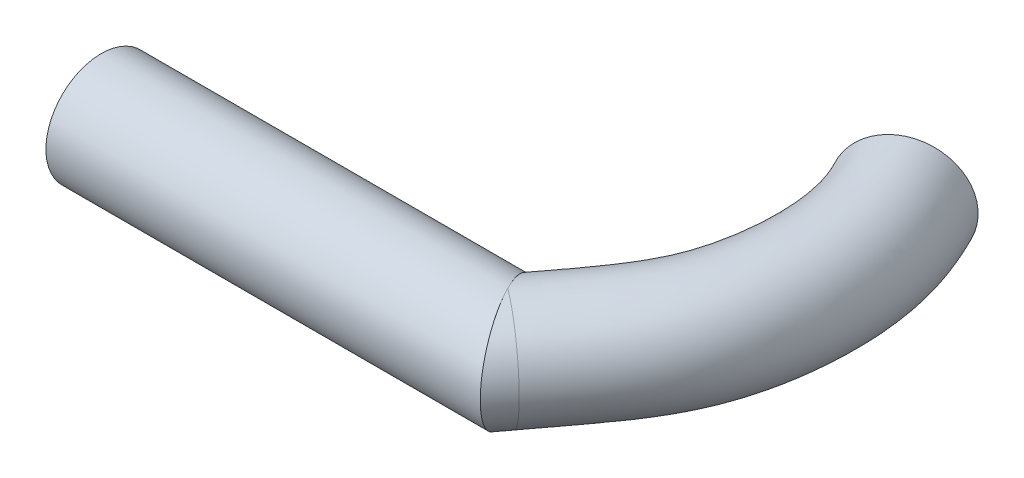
ISO-10303-21;
HEADER;
FILE_DESCRIPTION(('STEP AP214'),'2;1');
FILE_NAME('part.step','',(''),(''),'','','');
FILE_SCHEMA(('AUTOMOTIVE_DESIGN { 1 0 10303 214 1 1 1 1 }'));
ENDSEC;
DATA;
#1=APPLICATION_CONTEXT('core data for automotive mechanical design processes');
#2=APPLICATION_PROTOCOL_DEFINITION('international standard','automotive_design',2000,#1);
#3=PRODUCT_CONTEXT('',#1,'mechanical');
#4=PRODUCT('Part','Part','',(#3));
#5=PRODUCT_RELATED_PRODUCT_CATEGORY('part','',(#4));
#6=PRODUCT_DEFINITION_FORMATION('','',#4);
#7=PRODUCT_DEFINITION_CONTEXT('part definition',#1,'design');
#8=PRODUCT_DEFINITION('design','',#6,#7);
#9=PRODUCT_DEFINITION_SHAPE('','',#8);
#10=(LENGTH_UNIT() NAMED_UNIT(*) SI_UNIT(.MILLI.,.METRE.));
#11=(NAMED_UNIT(*) PLANE_ANGLE_UNIT() SI_UNIT($,.RADIAN.));
#12=(NAMED_UNIT(*) SI_UNIT($,.STERADIAN.) SOLID_ANGLE_UNIT());
#13=UNCERTAINTY_MEASURE_WITH_UNIT(LENGTH_MEASURE(1.E-05),#10,'distance_accuracy_value','');
#14=(GEOMETRIC_REPRESENTATION_CONTEXT(3) GLOBAL_UNCERTAINTY_ASSIGNED_CONTEXT((#13)) GLOBAL_UNIT_ASSIGNED_CONTEXT((#10,
#11,#12)) REPRESENTATION_CONTEXT('',''));
#15=CARTESIAN_POINT('',(0.,0.,0.));
#16=DIRECTION('',(0.,0.,1.));
#17=DIRECTION('',(1.,0.,0.));
#18=AXIS2_PLACEMENT_3D('',#15,#16,#17);
#19=CARTESIAN_POINT('',(78.3138482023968,53.7383808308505,0.));
#20=DIRECTION('',(-0.595766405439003,0.,0.803157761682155));
#21=DIRECTION('',(0.803157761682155,0.,0.595766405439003));
#22=AXIS2_PLACEMENT_3D('',#19,#20,#21);
#23=CYLINDRICAL_SURFACE('',#22,10.65);
#24=CARTESIAN_POINT('',(78.3138482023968,53.7383808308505,0.));
#25=DIRECTION('',(0.595766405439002,0.,-0.803157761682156));
#26=DIRECTION('',(-0.803157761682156,0.,-0.595766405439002));
#27=AXIS2_PLACEMENT_3D('',#24,#25,#26);
#28=CIRCLE('',#27,10.65);
#29=CARTESIAN_POINT('',(78.3138482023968,64.3883808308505,0.));
#30=VERTEX_POINT('',#29);
#31=CARTESIAN_POINT('',(78.3138482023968,43.0883808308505,0.));
#32=VERTEX_POINT('',#31);
#33=EDGE_CURVE('E108',#30,#32,#28,.T.);
#34=ORIENTED_EDGE('',*,*,#33,.F.);
#35=CARTESIAN_POINT('',(78.3138482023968,53.7383808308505,0.));
#36=DIRECTION('',(0.893243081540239,0.,-0.449574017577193));
#37=DIRECTION('',(0.449574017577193,0.,0.893243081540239));
#38=AXIS2_PLACEMENT_3D('',#35,#36,#37);
#39=ELLIPSE('',#38,11.9228463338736,10.65);
#40=EDGE_CURVE('E109',#30,#32,#39,.T.);
#41=ORIENTED_EDGE('',*,*,#40,.T.);
#42=EDGE_LOOP('',(#34,#41));
#43=FACE_BOUND('',#42,.T.);
#44=ADVANCED_FACE('F69',(#43),#23,.T.);
#45=CARTESIAN_POINT('',(78.3138482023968,53.7383808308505,0.));
#46=DIRECTION('',(-0.595766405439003,0.,0.803157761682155));
#47=DIRECTION('',(0.803157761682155,0.,0.595766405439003));
#48=AXIS2_PLACEMENT_3D('',#45,#46,#47);
#49=CYLINDRICAL_SURFACE('',#48,8.34999999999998);
#50=CARTESIAN_POINT('',(78.3138482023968,53.7383808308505,0.));
#51=DIRECTION('',(0.893243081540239,0.,-0.449574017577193));
#52=DIRECTION('',(0.449574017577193,0.,0.893243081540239));
#53=AXIS2_PLACEMENT_3D('',#50,#51,#52);
#54=ELLIPSE('',#53,9.34795933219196,8.34999999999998);
#55=CARTESIAN_POINT('',(78.3138482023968,62.0883808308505,0.));
#56=VERTEX_POINT('',#55);
#57=CARTESIAN_POINT('',(78.3138482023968,45.3883808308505,0.));
#58=VERTEX_POINT('',#57);
#59=EDGE_CURVE('E94',#56,#58,#54,.T.);
#60=ORIENTED_EDGE('',*,*,#59,.F.);
#61=CARTESIAN_POINT('',(78.3138482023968,53.7383808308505,0.));
#62=DIRECTION('',(0.595766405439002,0.,-0.803157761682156));
#63=DIRECTION('',(-0.803157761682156,0.,-0.595766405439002));
#64=AXIS2_PLACEMENT_3D('',#61,#62,#63);
#65=CIRCLE('',#64,8.34999999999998);
#66=EDGE_CURVE('E105',#56,#58,#65,.T.);
#67=ORIENTED_EDGE('',*,*,#66,.T.);
#68=EDGE_LOOP('',(#60,#67));
#69=FACE_BOUND('',#68,.T.);
#70=ADVANCED_FACE('F104',(#69),#49,.F.);
#71=CARTESIAN_POINT('',(91.029410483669,53.7383808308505,-63.5617452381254));
#72=DIRECTION('',(-0.455932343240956,0.,-0.890014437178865));
#73=DIRECTION('',(-0.890014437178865,0.,0.455932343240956));
#74=AXIS2_PLACEMENT_3D('',#71,#72,#73);
#75=PLANE('',#74);
#76=CARTESIAN_POINT('',(91.029410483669,53.7383808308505,-63.5617452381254));
#77=DIRECTION('',(-0.455932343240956,0.,-0.890014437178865));
#78=DIRECTION('',(-0.890014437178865,0.,0.455932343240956));
#79=AXIS2_PLACEMENT_3D('',#76,#77,#78);
#80=CIRCLE('',#79,8.34999999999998);
#81=CARTESIAN_POINT('',(83.5977899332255,53.7383808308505,-59.7547101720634));
#82=VERTEX_POINT('',#81);
#83=EDGE_CURVE('E111',#82,#82,#80,.T.);
#84=ORIENTED_EDGE('',*,*,#83,.F.);
#85=EDGE_LOOP('',(#84));
#86=FACE_BOUND('',#85,.T.);
#87=CARTESIAN_POINT('',(91.029410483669,53.7383808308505,-63.5617452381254));
#88=DIRECTION('',(-0.455932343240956,0.,-0.890014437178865));
#89=DIRECTION('',(-0.890014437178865,0.,0.455932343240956));
#90=AXIS2_PLACEMENT_3D('',#87,#88,#89);
#91=CIRCLE('',#90,10.65);
#92=CARTESIAN_POINT('',(81.5507567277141,53.7383808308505,-58.7060657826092));
#93=VERTEX_POINT('',#92);
#94=EDGE_CURVE('E81',#93,#93,#91,.T.);
#95=ORIENTED_EDGE('',*,*,#94,.T.);
#96=EDGE_LOOP('',(#95));
#97=FACE_BOUND('',#96,.T.);
#98=ADVANCED_FACE('F121',(#86,#97),#75,.T.);
#99=CARTESIAN_POINT('',(81.5507567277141,53.7383808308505,-58.7060657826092));
#100=CARTESIAN_POINT('',(82.8786348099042,53.7383808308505,-56.2032188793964));
#101=CARTESIAN_POINT('',(84.548425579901,53.7383808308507,-51.7664991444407));
#102=CARTESIAN_POINT('',(85.3403182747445,53.7383808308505,-47.1848290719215));
#103=CARTESIAN_POINT('',(85.7042953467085,53.7383808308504,-42.1390190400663));
#104=CARTESIAN_POINT('',(85.5759898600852,53.7383808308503,-36.2475260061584));
#105=CARTESIAN_POINT('',(84.4349783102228,53.7383808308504,-30.6019649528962));
#106=CARTESIAN_POINT('',(82.9979298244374,53.7383808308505,-26.0586618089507));
#107=CARTESIAN_POINT('',(81.1404006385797,53.7383808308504,-22.0645461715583));
#108=CARTESIAN_POINT('',(76.8912262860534,53.7383808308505,-15.7107844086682));
#109=CARTESIAN_POINT('',(72.2878550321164,53.7383808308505,-9.75060302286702));
#110=CARTESIAN_POINT('',(69.7602180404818,53.7383808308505,-6.34491221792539));
#111=CARTESIAN_POINT('',(81.5507567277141,32.4383808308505,-58.7060657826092));
#112=CARTESIAN_POINT('',(82.8786348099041,32.4383808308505,-56.2032188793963));
#113=CARTESIAN_POINT('',(84.5484255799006,32.4383808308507,-51.7664991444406));
#114=CARTESIAN_POINT('',(85.3403182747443,32.4383808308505,-47.1848290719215));
#115=CARTESIAN_POINT('',(85.7042953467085,32.4383808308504,-42.1390190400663));
#116=CARTESIAN_POINT('',(85.5759898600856,32.4383808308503,-36.2475260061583));
#117=CARTESIAN_POINT('',(84.4349783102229,32.4383808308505,-30.6019649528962));
#118=CARTESIAN_POINT('',(82.9979298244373,32.4383808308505,-26.0586618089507));
#119=CARTESIAN_POINT('',(81.1404006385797,32.4383808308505,-22.0645461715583));
#120=CARTESIAN_POINT('',(76.8912262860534,32.4383808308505,-15.7107844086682));
#121=CARTESIAN_POINT('',(72.2878550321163,32.4383808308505,-9.75060302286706));
#122=CARTESIAN_POINT('',(69.7602180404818,32.4383808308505,-6.34491221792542));
#123=CARTESIAN_POINT('',(100.508064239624,32.4383808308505,-68.4174246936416));
#124=CARTESIAN_POINT('',(102.42940117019,32.4383808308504,-64.5775580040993));
#125=CARTESIAN_POINT('',(105.214732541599,32.4383808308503,-57.627606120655));
#126=CARTESIAN_POINT('',(106.486193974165,32.4383808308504,-50.0105061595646));
#127=CARTESIAN_POINT('',(107.055525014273,32.4383808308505,-42.2724069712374));
#128=CARTESIAN_POINT('',(106.835829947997,32.4383808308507,-34.0211809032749));
#129=CARTESIAN_POINT('',(105.233768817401,32.4383808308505,-25.6366099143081));
#130=CARTESIAN_POINT('',(102.812711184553,32.4383808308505,-18.1837587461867));
#131=CARTESIAN_POINT('',(99.5645066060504,32.4383808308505,-11.1155226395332));
#132=CARTESIAN_POINT('',(93.7977548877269,32.4383808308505,-2.76138064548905));
#133=CARTESIAN_POINT('',(89.3282047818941,32.4383808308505,3.02574785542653));
#134=CARTESIAN_POINT('',(86.8674783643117,32.4383808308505,6.34491221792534));
#135=CARTESIAN_POINT('',(100.508064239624,53.7383808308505,-68.4174246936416));
#136=CARTESIAN_POINT('',(102.42940117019,53.7383808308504,-64.5775580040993));
#137=CARTESIAN_POINT('',(105.2147325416,53.7383808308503,-57.6276061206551));
#138=CARTESIAN_POINT('',(106.486193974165,53.7383808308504,-50.0105061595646));
#139=CARTESIAN_POINT('',(107.055525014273,53.7383808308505,-42.2724069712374));
#140=CARTESIAN_POINT('',(106.835829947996,53.7383808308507,-34.021180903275));
#141=CARTESIAN_POINT('',(105.233768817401,53.7383808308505,-25.6366099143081));
#142=CARTESIAN_POINT('',(102.812711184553,53.7383808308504,-18.1837587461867));
#143=CARTESIAN_POINT('',(99.5645066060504,53.7383808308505,-11.1155226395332));
#144=CARTESIAN_POINT('',(93.7977548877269,53.7383808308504,-2.761380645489));
#145=CARTESIAN_POINT('',(89.3282047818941,53.7383808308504,3.02574785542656));
#146=CARTESIAN_POINT('',(86.8674783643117,53.7383808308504,6.34491221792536));
#147=CARTESIAN_POINT('',(100.508064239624,75.0383808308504,-68.4174246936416));
#148=CARTESIAN_POINT('',(102.42940117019,75.0383808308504,-64.5775580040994));
#149=CARTESIAN_POINT('',(105.2147325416,75.0383808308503,-57.6276061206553));
#150=CARTESIAN_POINT('',(106.486193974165,75.0383808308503,-50.0105061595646));
#151=CARTESIAN_POINT('',(107.055525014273,75.0383808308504,-42.2724069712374));
#152=CARTESIAN_POINT('',(106.835829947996,75.0383808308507,-34.0211809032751));
#153=CARTESIAN_POINT('',(105.233768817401,75.0383808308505,-25.6366099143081));
#154=CARTESIAN_POINT('',(102.812711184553,75.0383808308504,-18.1837587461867));
#155=CARTESIAN_POINT('',(99.5645066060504,75.0383808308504,-11.1155226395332));
#156=CARTESIAN_POINT('',(93.797754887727,75.0383808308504,-2.76138064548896));
#157=CARTESIAN_POINT('',(89.3282047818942,75.0383808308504,3.0257478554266));
#158=CARTESIAN_POINT('',(86.8674783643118,75.0383808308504,6.3449122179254));
#159=CARTESIAN_POINT('',(81.5507567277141,75.0383808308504,-58.7060657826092));
#160=CARTESIAN_POINT('',(82.8786348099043,75.0383808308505,-56.2032188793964));
#161=CARTESIAN_POINT('',(84.5484255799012,75.0383808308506,-51.7664991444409));
#162=CARTESIAN_POINT('',(85.3403182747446,75.0383808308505,-47.1848290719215));
#163=CARTESIAN_POINT('',(85.7042953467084,75.0383808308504,-42.1390190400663));
#164=CARTESIAN_POINT('',(85.5759898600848,75.0383808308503,-36.2475260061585));
#165=CARTESIAN_POINT('',(84.4349783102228,75.0383808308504,-30.6019649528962));
#166=CARTESIAN_POINT('',(82.9979298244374,75.0383808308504,-26.0586618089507));
#167=CARTESIAN_POINT('',(81.1404006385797,75.0383808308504,-22.0645461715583));
#168=CARTESIAN_POINT('',(76.8912262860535,75.0383808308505,-15.7107844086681));
#169=CARTESIAN_POINT('',(72.2878550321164,75.0383808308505,-9.75060302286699));
#170=CARTESIAN_POINT('',(69.7602180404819,75.0383808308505,-6.34491221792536));
#171=CARTESIAN_POINT('',(81.5507567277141,53.7383808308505,-58.7060657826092));
#172=CARTESIAN_POINT('',(82.8786348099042,53.7383808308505,-56.2032188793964));
#173=CARTESIAN_POINT('',(84.548425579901,53.7383808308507,-51.7664991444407));
#174=CARTESIAN_POINT('',(85.3403182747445,53.7383808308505,-47.1848290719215));
#175=CARTESIAN_POINT('',(85.7042953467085,53.7383808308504,-42.1390190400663));
#176=CARTESIAN_POINT('',(85.5759898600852,53.7383808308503,-36.2475260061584));
#177=CARTESIAN_POINT('',(84.4349783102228,53.7383808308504,-30.6019649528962));
#178=CARTESIAN_POINT('',(82.9979298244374,53.7383808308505,-26.0586618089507));
#179=CARTESIAN_POINT('',(81.1404006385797,53.7383808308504,-22.0645461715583));
#180=CARTESIAN_POINT('',(76.8912262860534,53.7383808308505,-15.7107844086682));
#181=CARTESIAN_POINT('',(72.2878550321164,53.7383808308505,-9.75060302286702));
#182=CARTESIAN_POINT('',(69.7602180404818,53.7383808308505,-6.34491221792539));
#183=(BOUNDED_SURFACE() B_SPLINE_SURFACE(3,3,((#99,#100,#101,#102,#103,#104,#105,#106,#107,#108,
#109,#110),(#111,#112,#113,#114,#115,#116,#117,#118,#119,#120,#121,#122),(#123,#124,#125,#126,
#127,#128,#129,#130,#131,#132,#133,#134),(#135,#136,#137,#138,#139,#140,#141,#142,#143,#144,
#145,#146),(#147,#148,#149,#150,#151,#152,#153,#154,#155,#156,#157,#158),(#159,#160,#161,#162,
#163,#164,#165,#166,#167,#168,#169,#170),(#171,#172,#173,#174,#175,#176,#177,#178,#179,#180,
#181,#182)),.UNSPECIFIED.,.T.,.F.,.F.) B_SPLINE_SURFACE_WITH_KNOTS((4,3,4),(4,1,1,1,1,1,1,1,1,
4),(0.,0.5,1.),(0.,0.14,0.263161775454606,0.280000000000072,0.42,0.559999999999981,
0.585352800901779,0.706666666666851,0.853333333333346,1.),
.UNSPECIFIED.) GEOMETRIC_REPRESENTATION_ITEM() RATIONAL_B_SPLINE_SURFACE(((1.,1.,1.,1.,1.,1.,1.,
1.,1.,1.,1.,1.),(0.333333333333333,0.333333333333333,0.333333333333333,0.333333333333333,
0.333333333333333,0.333333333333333,0.333333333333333,0.333333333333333,0.333333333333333,
0.333333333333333,0.333333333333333,0.333333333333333),(0.333333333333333,0.333333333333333,
0.333333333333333,0.333333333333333,0.333333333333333,0.333333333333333,0.333333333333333,
0.333333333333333,0.333333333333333,0.333333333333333,0.333333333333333,0.333333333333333),(1.,
1.,1.,1.,1.,1.,1.,1.,1.,1.,1.,1.),(0.333333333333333,0.333333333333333,0.333333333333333,
0.333333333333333,0.333333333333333,0.333333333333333,0.333333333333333,0.333333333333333,
0.333333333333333,0.333333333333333,0.333333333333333,0.333333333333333),(0.333333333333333,
0.333333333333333,0.333333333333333,0.333333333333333,0.333333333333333,0.333333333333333,
0.333333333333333,0.333333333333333,0.333333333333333,0.333333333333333,0.333333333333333,
0.333333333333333),(1.,1.,1.,1.,1.,1.,1.,1.,1.,1.,1.,1.))) REPRESENTATION_ITEM('') SURFACE());
#184=CARTESIAN_POINT('',(78.3138482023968,64.3883808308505,0.));
#185=CARTESIAN_POINT('',(78.1495773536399,64.3883922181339,-0.326384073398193));
#186=CARTESIAN_POINT('',(77.985299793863,64.3733771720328,-0.652781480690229));
#187=CARTESIAN_POINT('',(77.657824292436,64.3133020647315,-1.30343123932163));
#188=CARTESIAN_POINT('',(77.4946265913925,64.2682355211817,-1.62768311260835));
#189=CARTESIAN_POINT('',(77.1699527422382,64.1478713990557,-2.27276636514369));
#190=CARTESIAN_POINT('',(77.0084838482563,64.0724767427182,-2.59358333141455));
#191=CARTESIAN_POINT('',(76.6889971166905,63.8915775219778,-3.22836047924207));
#192=CARTESIAN_POINT('',(76.5309790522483,63.7860749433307,-3.5423211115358));
#193=CARTESIAN_POINT('',(76.2193067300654,63.5449458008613,-4.16157207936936));
#194=CARTESIAN_POINT('',(76.0656615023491,63.4092613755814,-4.46684447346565));
#195=CARTESIAN_POINT('',(75.7643506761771,63.1082647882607,-5.0655085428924));
#196=CARTESIAN_POINT('',(75.6166847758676,62.9429541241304,-5.35890081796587));
#197=CARTESIAN_POINT('',(75.3288377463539,62.5834719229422,-5.93081413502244));
#198=CARTESIAN_POINT('',(75.1886484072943,62.3893329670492,-6.20935148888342));
#199=CARTESIAN_POINT('',(74.9169934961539,61.9728856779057,-6.74909324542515));
#200=CARTESIAN_POINT('',(74.7855271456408,61.7505798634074,-7.0102991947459));
#201=CARTESIAN_POINT('',(74.5410887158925,61.2944540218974,-7.49596546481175));
#202=CARTESIAN_POINT('',(74.4274690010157,61.0623512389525,-7.72171255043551));
#203=CARTESIAN_POINT('',(74.2103483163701,60.5758163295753,-8.15310213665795));
#204=CARTESIAN_POINT('',(74.1068459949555,60.321387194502,-8.35874732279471));
#205=CARTESIAN_POINT('',(73.9112102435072,59.7918588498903,-8.74744923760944));
#206=CARTESIAN_POINT('',(73.8190731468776,59.5167663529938,-8.93051325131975));
#207=CARTESIAN_POINT('',(73.6473425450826,58.9478440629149,-9.27171885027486));
#208=CARTESIAN_POINT('',(73.5677474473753,58.654016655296,-9.42986359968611));
#209=CARTESIAN_POINT('',(73.4302052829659,58.0831423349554,-9.70314137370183));
#210=CARTESIAN_POINT('',(73.3708422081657,57.8077800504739,-9.82108781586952));
#211=CARTESIAN_POINT('',(73.2636898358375,57.246147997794,-10.0339851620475));
#212=CARTESIAN_POINT('',(73.2158988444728,56.9598798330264,-10.1289394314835));
#213=CARTESIAN_POINT('',(73.132531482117,56.3788505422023,-10.294579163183));
#214=CARTESIAN_POINT('',(73.096947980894,56.0840944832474,-10.3652787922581));
#215=CARTESIAN_POINT('',(73.0384458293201,55.4884281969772,-10.4815146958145));
#216=CARTESIAN_POINT('',(73.0155263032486,55.187518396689,-10.5270527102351));
#217=CARTESIAN_POINT('',(72.9841648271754,54.6097084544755,-10.5893637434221));
#218=CARTESIAN_POINT('',(72.974597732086,54.3331077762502,-10.6083722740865));
#219=CARTESIAN_POINT('',(72.9663105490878,53.7791146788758,-10.6248377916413));
#220=CARTESIAN_POINT('',(72.9675896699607,53.5017223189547,-10.6222963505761));
#221=CARTESIAN_POINT('',(72.9809774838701,52.9482889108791,-10.5956965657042));
#222=CARTESIAN_POINT('',(72.9930842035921,52.6722476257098,-10.5716421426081));
#223=CARTESIAN_POINT('',(73.0279801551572,52.1235279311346,-10.5023085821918));
#224=CARTESIAN_POINT('',(73.0507694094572,51.8508495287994,-10.4570294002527));
#225=CARTESIAN_POINT('',(73.1059673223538,51.3185241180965,-10.3473585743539));
#226=CARTESIAN_POINT('',(73.1380842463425,51.0587269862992,-10.2835465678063));
#227=CARTESIAN_POINT('',(73.2118065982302,50.5458967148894,-10.1370701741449));
#228=CARTESIAN_POINT('',(73.2534117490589,50.292863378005,-10.0544063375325));
#229=CARTESIAN_POINT('',(73.3456900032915,49.7951058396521,-9.87106186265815));
#230=CARTESIAN_POINT('',(73.3963637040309,49.5503821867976,-9.77038003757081));
#231=CARTESIAN_POINT('',(73.5062885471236,49.0706639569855,-9.55197416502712));
#232=CARTESIAN_POINT('',(73.565539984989,48.8356697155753,-9.43424953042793));
#233=CARTESIAN_POINT('',(73.6946133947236,48.3674761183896,-9.1777980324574));
#234=CARTESIAN_POINT('',(73.764763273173,48.1347241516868,-9.03841966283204));
#235=CARTESIAN_POINT('',(73.9131152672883,47.68229827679,-8.74366421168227));
#236=CARTESIAN_POINT('',(73.9913175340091,47.4626246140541,-8.58828683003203));
#237=CARTESIAN_POINT('',(74.1551093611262,47.0373744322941,-8.26285450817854));
#238=CARTESIAN_POINT('',(74.2406988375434,46.8317977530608,-8.09279973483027));
#239=CARTESIAN_POINT('',(74.4186261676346,46.435509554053,-7.73928207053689));
#240=CARTESIAN_POINT('',(74.5109665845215,46.2448037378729,-7.55581408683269));
#241=CARTESIAN_POINT('',(74.7099426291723,45.86322375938,-7.16047545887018));
#242=CARTESIAN_POINT('',(74.8171241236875,45.6737571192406,-6.94752025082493));
#243=CARTESIAN_POINT('',(75.0378364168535,45.3139031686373,-6.50899462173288));
#244=CARTESIAN_POINT('',(75.1513699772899,45.1435242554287,-6.28341871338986));
#245=CARTESIAN_POINT('',(75.3839748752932,44.8224077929,-5.82126407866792));
#246=CARTESIAN_POINT('',(75.5030483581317,44.671677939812,-5.58468108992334));
#247=CARTESIAN_POINT('',(75.7459079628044,44.39033181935,-5.10215173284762));
#248=CARTESIAN_POINT('',(75.869694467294,44.259717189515,-4.85620460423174));
#249=CARTESIAN_POINT('',(76.1341685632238,44.0065035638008,-4.33073016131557));
#250=CARTESIAN_POINT('',(76.2752842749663,43.8861135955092,-4.05035222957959));
#251=CARTESIAN_POINT('',(76.56129830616,43.6704731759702,-3.4820808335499));
#252=CARTESIAN_POINT('',(76.7061956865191,43.5752165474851,-3.19418923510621));
#253=CARTESIAN_POINT('',(76.9987648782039,43.4100233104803,-2.61289361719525));
#254=CARTESIAN_POINT('',(77.1464346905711,43.340069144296,-2.31949356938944));
#255=CARTESIAN_POINT('',(77.4436932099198,43.2254994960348,-1.72888088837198));
#256=CARTESIAN_POINT('',(77.5932811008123,43.1808735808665,-1.43166987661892));
#257=CARTESIAN_POINT('',(77.8382663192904,43.1287120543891,-0.944917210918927));
#258=CARTESIAN_POINT('',(77.9333499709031,43.1135707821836,-0.755998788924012));
#259=CARTESIAN_POINT('',(78.1235693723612,43.0934142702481,-0.378058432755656));
#260=CARTESIAN_POINT('',(78.2187047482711,43.0883815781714,-0.189037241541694));
#261=CARTESIAN_POINT('',(78.3138482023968,43.0883808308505,0.));
#262=B_SPLINE_CURVE_WITH_KNOTS('',3,(#184,#185,#186,#187,#188,#189,#190,#191,#192,#193,#194,
#195,#196,#197,#198,#199,#200,#201,#202,#203,#204,#205,#206,#207,#208,#209,#210,#211,#212,#213,
#214,#215,#216,#217,#218,#219,#220,#221,#222,#223,#224,#225,#226,#227,#228,#229,#230,#231,#232,
#233,#234,#235,#236,#237,#238,#239,#240,#241,#242,#243,#244,#245,#246,#247,#248,#249,#250,#251,
#252,#253,#254,#255,#256,#257,#258,#259,#260,#261),.UNSPECIFIED.,.F.,.F.,(4,2,2,2,2,2,2,2,2,2,2,
2,2,2,2,2,2,2,2,2,2,2,2,2,2,2,2,2,2,2,2,2,2,2,2,2,2,2,4),(0.,1.09589237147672,2.19202121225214,
3.29168695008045,4.39128017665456,5.49299987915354,6.59466389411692,7.69509217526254,
8.7954221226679,9.82342852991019,10.8512974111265,11.878833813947,12.9062396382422,
13.8211655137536,14.7359573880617,15.6502140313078,16.5644074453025,17.3956324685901,
18.2267968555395,19.0578097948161,19.8888244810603,20.6962259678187,21.5036038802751,
22.3110349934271,23.1184939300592,23.9582356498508,24.797993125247,25.6377410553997,
26.4778094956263,27.3904202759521,28.3034309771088,29.2167982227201,30.1302397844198,
31.1377063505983,32.1449250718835,33.1514435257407,34.157547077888,34.7934402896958,
35.4282346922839),.UNSPECIFIED.);
#263=EDGE_CURVE('E87',#30,#32,#262,.T.);
#264=ORIENTED_EDGE('',*,*,#263,.F.);
#265=ORIENTED_EDGE('',*,*,#33,.T.);
#266=EDGE_LOOP('',(#264,#265));
#267=FACE_BOUND('',#266,.T.);
#268=ORIENTED_EDGE('',*,*,#94,.F.);
#269=EDGE_LOOP('',(#268));
#270=FACE_BOUND('',#269,.T.);
#271=ADVANCED_FACE('F123',(#267,#270),#183,.T.);
#272=CARTESIAN_POINT('',(83.5977899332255,53.7383808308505,-59.7547101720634));
#273=CARTESIAN_POINT('',(84.9897504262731,53.7383808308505,-57.1074902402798));
#274=CARTESIAN_POINT('',(86.7799986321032,53.7383808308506,-52.3993886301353));
#275=CARTESIAN_POINT('',(87.623675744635,53.7383808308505,-47.4899491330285));
#276=CARTESIAN_POINT('',(88.009827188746,53.7383808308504,-42.1534224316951));
#277=CARTESIAN_POINT('',(87.8716533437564,53.7383808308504,-36.0071225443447));
#278=CARTESIAN_POINT('',(86.6808570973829,53.7383808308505,-30.0657998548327));
#279=CARTESIAN_POINT('',(85.1375541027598,53.7383808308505,-25.2083201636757));
#280=CARTESIAN_POINT('',(83.1298580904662,53.7383808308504,-20.882257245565));
#281=CARTESIAN_POINT('',(78.7168138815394,53.7383808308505,-14.3124919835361));
#282=CARTESIAN_POINT('',(74.1278927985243,53.7383808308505,-8.37099705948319));
#283=CARTESIAN_POINT('',(71.6074808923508,53.7383808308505,-4.97464948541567));
#284=CARTESIAN_POINT('',(83.5977899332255,37.0383808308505,-59.7547101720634));
#285=CARTESIAN_POINT('',(84.989750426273,37.0383808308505,-57.1074902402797));
#286=CARTESIAN_POINT('',(86.7799986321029,37.0383808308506,-52.3993886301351));
#287=CARTESIAN_POINT('',(87.6236757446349,37.0383808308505,-47.4899491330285));
#288=CARTESIAN_POINT('',(88.009827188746,37.0383808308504,-42.1534224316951));
#289=CARTESIAN_POINT('',(87.8716533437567,37.0383808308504,-36.0071225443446));
#290=CARTESIAN_POINT('',(86.6808570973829,37.0383808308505,-30.0657998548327));
#291=CARTESIAN_POINT('',(85.1375541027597,37.0383808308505,-25.2083201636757));
#292=CARTESIAN_POINT('',(83.1298580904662,37.0383808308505,-20.8822572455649));
#293=CARTESIAN_POINT('',(78.7168138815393,37.0383808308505,-14.3124919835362));
#294=CARTESIAN_POINT('',(74.1278927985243,37.0383808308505,-8.37099705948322));
#295=CARTESIAN_POINT('',(71.6074808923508,37.0383808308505,-4.97464948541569));
#296=CARTESIAN_POINT('',(98.4610310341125,37.0383808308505,-67.3687803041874));
#297=CARTESIAN_POINT('',(100.318285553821,37.0383808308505,-63.6732866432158));
#298=CARTESIAN_POINT('',(102.983159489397,37.0383808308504,-56.9947166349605));
#299=CARTESIAN_POINT('',(104.202836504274,37.0383808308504,-49.7053860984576));
#300=CARTESIAN_POINT('',(104.749993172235,37.0383808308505,-42.2580035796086));
#301=CARTESIAN_POINT('',(104.540166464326,37.0383808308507,-34.2615843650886));
#302=CARTESIAN_POINT('',(102.987890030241,37.0383808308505,-26.1727750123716));
#303=CARTESIAN_POINT('',(100.673086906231,37.0383808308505,-19.0341003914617));
#304=CARTESIAN_POINT('',(97.5750491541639,37.0383808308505,-12.2978115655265));
#305=CARTESIAN_POINT('',(91.972167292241,37.0383808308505,-4.15967307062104));
#306=CARTESIAN_POINT('',(87.4881670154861,37.0383808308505,1.64614189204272));
#307=CARTESIAN_POINT('',(85.0202155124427,37.0383808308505,4.97464948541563));
#308=CARTESIAN_POINT('',(98.4610310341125,53.7383808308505,-67.3687803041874));
#309=CARTESIAN_POINT('',(100.318285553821,53.7383808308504,-63.6732866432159));
#310=CARTESIAN_POINT('',(102.983159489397,53.7383808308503,-56.9947166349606));
#311=CARTESIAN_POINT('',(104.202836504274,53.7383808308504,-49.7053860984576));
#312=CARTESIAN_POINT('',(104.749993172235,53.7383808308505,-42.2580035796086));
#313=CARTESIAN_POINT('',(104.540166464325,53.7383808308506,-34.2615843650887));
#314=CARTESIAN_POINT('',(102.987890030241,53.7383808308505,-26.1727750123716));
#315=CARTESIAN_POINT('',(100.673086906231,53.7383808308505,-19.0341003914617));
#316=CARTESIAN_POINT('',(97.5750491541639,53.7383808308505,-12.2978115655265));
#317=CARTESIAN_POINT('',(91.9721672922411,53.7383808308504,-4.15967307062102));
#318=CARTESIAN_POINT('',(87.4881670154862,53.7383808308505,1.64614189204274));
#319=CARTESIAN_POINT('',(85.0202155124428,53.7383808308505,4.97464948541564));
#320=CARTESIAN_POINT('',(98.4610310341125,70.4383808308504,-67.3687803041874));
#321=CARTESIAN_POINT('',(100.318285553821,70.4383808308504,-63.6732866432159));
#322=CARTESIAN_POINT('',(102.983159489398,70.4383808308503,-56.9947166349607));
#323=CARTESIAN_POINT('',(104.202836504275,70.4383808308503,-49.7053860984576));
#324=CARTESIAN_POINT('',(104.749993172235,70.4383808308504,-42.2580035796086));
#325=CARTESIAN_POINT('',(104.540166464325,70.4383808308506,-34.2615843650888));
#326=CARTESIAN_POINT('',(102.98789003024,70.4383808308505,-26.1727750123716));
#327=CARTESIAN_POINT('',(100.673086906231,70.4383808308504,-19.0341003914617));
#328=CARTESIAN_POINT('',(97.5750491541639,70.4383808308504,-12.2978115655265));
#329=CARTESIAN_POINT('',(91.9721672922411,70.4383808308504,-4.15967307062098));
#330=CARTESIAN_POINT('',(87.4881670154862,70.4383808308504,1.64614189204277));
#331=CARTESIAN_POINT('',(85.0202155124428,70.4383808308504,4.97464948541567));
#332=CARTESIAN_POINT('',(83.5977899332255,70.4383808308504,-59.7547101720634));
#333=CARTESIAN_POINT('',(84.9897504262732,70.4383808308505,-57.1074902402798));
#334=CARTESIAN_POINT('',(86.7799986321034,70.4383808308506,-52.3993886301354));
#335=CARTESIAN_POINT('',(87.6236757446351,70.4383808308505,-47.4899491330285));
#336=CARTESIAN_POINT('',(88.0098271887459,70.4383808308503,-42.1534224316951));
#337=CARTESIAN_POINT('',(87.8716533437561,70.4383808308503,-36.0071225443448));
#338=CARTESIAN_POINT('',(86.6808570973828,70.4383808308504,-30.0657998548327));
#339=CARTESIAN_POINT('',(85.1375541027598,70.4383808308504,-25.2083201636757));
#340=CARTESIAN_POINT('',(83.1298580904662,70.4383808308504,-20.882257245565));
#341=CARTESIAN_POINT('',(78.7168138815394,70.4383808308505,-14.3124919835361));
#342=CARTESIAN_POINT('',(74.1278927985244,70.4383808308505,-8.37099705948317));
#343=CARTESIAN_POINT('',(71.6074808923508,70.4383808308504,-4.97464948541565));
#344=CARTESIAN_POINT('',(83.5977899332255,53.7383808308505,-59.7547101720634));
#345=CARTESIAN_POINT('',(84.9897504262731,53.7383808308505,-57.1074902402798));
#346=CARTESIAN_POINT('',(86.7799986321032,53.7383808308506,-52.3993886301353));
#347=CARTESIAN_POINT('',(87.623675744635,53.7383808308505,-47.4899491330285));
#348=CARTESIAN_POINT('',(88.009827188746,53.7383808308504,-42.1534224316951));
#349=CARTESIAN_POINT('',(87.8716533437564,53.7383808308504,-36.0071225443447));
#350=CARTESIAN_POINT('',(86.6808570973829,53.7383808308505,-30.0657998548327));
#351=CARTESIAN_POINT('',(85.1375541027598,53.7383808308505,-25.2083201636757));
#352=CARTESIAN_POINT('',(83.1298580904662,53.7383808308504,-20.882257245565));
#353=CARTESIAN_POINT('',(78.7168138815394,53.7383808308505,-14.3124919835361));
#354=CARTESIAN_POINT('',(74.1278927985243,53.7383808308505,-8.37099705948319));
#355=CARTESIAN_POINT('',(71.6074808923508,53.7383808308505,-4.97464948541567));
#356=(BOUNDED_SURFACE() B_SPLINE_SURFACE(3,3,((#272,#273,#274,#275,#276,#277,#278,#279,#280,
#281,#282,#283),(#284,#285,#286,#287,#288,#289,#290,#291,#292,#293,#294,#295),(#296,#297,#298,
#299,#300,#301,#302,#303,#304,#305,#306,#307),(#308,#309,#310,#311,#312,#313,#314,#315,#316,
#317,#318,#319),(#320,#321,#322,#323,#324,#325,#326,#327,#328,#329,#330,#331),(#332,#333,#334,
#335,#336,#337,#338,#339,#340,#341,#342,#343),(#344,#345,#346,#347,#348,#349,#350,#351,#352,
#353,#354,#355)),.UNSPECIFIED.,.T.,.F.,.F.) B_SPLINE_SURFACE_WITH_KNOTS((4,3,4),(4,1,1,1,1,1,1,
1,1,4),(0.,0.5,1.),(0.,0.14,0.263161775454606,0.280000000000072,0.42,0.559999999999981,
0.585352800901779,0.706666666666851,0.853333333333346,1.),
.UNSPECIFIED.) GEOMETRIC_REPRESENTATION_ITEM() RATIONAL_B_SPLINE_SURFACE(((1.,1.,1.,1.,1.,1.,1.,
1.,1.,1.,1.,1.),(0.333333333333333,0.333333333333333,0.333333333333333,0.333333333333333,
0.333333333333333,0.333333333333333,0.333333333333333,0.333333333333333,0.333333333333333,
0.333333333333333,0.333333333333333,0.333333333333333),(0.333333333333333,0.333333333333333,
0.333333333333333,0.333333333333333,0.333333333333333,0.333333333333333,0.333333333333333,
0.333333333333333,0.333333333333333,0.333333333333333,0.333333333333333,0.333333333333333),(1.,
1.,1.,1.,1.,1.,1.,1.,1.,1.,1.,1.),(0.333333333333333,0.333333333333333,0.333333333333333,
0.333333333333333,0.333333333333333,0.333333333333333,0.333333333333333,0.333333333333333,
0.333333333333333,0.333333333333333,0.333333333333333,0.333333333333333),(0.333333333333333,
0.333333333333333,0.333333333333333,0.333333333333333,0.333333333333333,0.333333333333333,
0.333333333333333,0.333333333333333,0.333333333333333,0.333333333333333,0.333333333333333,
0.333333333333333),(1.,1.,1.,1.,1.,1.,1.,1.,1.,1.,1.,1.))) REPRESENTATION_ITEM('') SURFACE());
#357=CARTESIAN_POINT('',(78.3138482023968,62.0883808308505,0.));
#358=CARTESIAN_POINT('',(78.1849632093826,62.0883893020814,-0.25607713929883));
#359=CARTESIAN_POINT('',(78.0560732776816,62.076600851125,-0.512164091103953));
#360=CARTESIAN_POINT('',(77.7991415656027,62.0294440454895,-1.02265283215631));
#361=CARTESIAN_POINT('',(77.6710999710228,61.9940706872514,-1.2770542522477));
#362=CARTESIAN_POINT('',(77.4163655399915,61.8996049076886,-1.78317729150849));
#363=CARTESIAN_POINT('',(77.289678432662,61.8404358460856,-2.03488752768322));
#364=CARTESIAN_POINT('',(77.0390117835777,61.6984775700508,-2.53292843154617));
#365=CARTESIAN_POINT('',(76.915032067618,61.6156898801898,-2.77925944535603));
#366=CARTESIAN_POINT('',(76.6704981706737,61.4264858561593,-3.26511539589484));
#367=CARTESIAN_POINT('',(76.5499510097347,61.3200245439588,-3.50462638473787));
#368=CARTESIAN_POINT('',(76.3135476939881,61.0838598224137,-3.97432796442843));
#369=CARTESIAN_POINT('',(76.1976913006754,60.9541575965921,-4.20451902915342));
#370=CARTESIAN_POINT('',(75.9718512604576,60.6721087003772,-4.65323280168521));
#371=CARTESIAN_POINT('',(75.8618611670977,60.5197876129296,-4.87176831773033));
#372=CARTESIAN_POINT('',(75.6487275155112,60.1930384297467,-5.29523620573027));
#373=CARTESIAN_POINT('',(75.5455833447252,60.0186123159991,-5.50016979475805));
#374=CARTESIAN_POINT('',(75.3538131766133,59.6607231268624,-5.8811913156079));
#375=CARTESIAN_POINT('',(75.2646784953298,59.4786087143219,-6.05828993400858));
#376=CARTESIAN_POINT('',(75.09435457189,59.0968506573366,-6.3967006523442));
#377=CARTESIAN_POINT('',(75.013164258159,58.8972093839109,-6.55801488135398));
#378=CARTESIAN_POINT('',(74.8597133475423,58.4817006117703,-6.86290119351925));
#379=CARTESIAN_POINT('',(74.787449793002,58.265838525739,-7.00647915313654));
#380=CARTESIAN_POINT('',(74.652775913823,57.8194050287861,-7.27405803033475));
#381=CARTESIAN_POINT('',(74.5903643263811,57.5888355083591,-7.39806145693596));
#382=CARTESIAN_POINT('',(74.4825786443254,57.1410452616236,-7.61221710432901));
#383=CARTESIAN_POINT('',(74.4360847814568,56.9251554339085,-7.7045941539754));
#384=CARTESIAN_POINT('',(74.3521719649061,56.4848269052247,-7.87131762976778));
#385=CARTESIAN_POINT('',(74.3147518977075,56.2603892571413,-7.94566626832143));
#386=CARTESIAN_POINT('',(74.2494901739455,55.8048665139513,-8.0753325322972));
#387=CARTESIAN_POINT('',(74.221642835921,55.5737854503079,-8.13066144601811));
#388=CARTESIAN_POINT('',(74.1758781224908,55.1068084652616,-8.22158977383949));
#389=CARTESIAN_POINT('',(74.1579600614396,54.8709128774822,-8.25719055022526));
#390=CARTESIAN_POINT('',(74.1334716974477,54.4179954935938,-8.30584563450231));
#391=CARTESIAN_POINT('',(74.1260176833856,54.2012079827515,-8.32065575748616));
#392=CARTESIAN_POINT('',(74.1196094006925,53.7670164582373,-8.33338815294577));
#393=CARTESIAN_POINT('',(74.1206546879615,53.5496124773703,-8.33131130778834));
#394=CARTESIAN_POINT('',(74.1312312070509,53.1158740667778,-8.31029718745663));
#395=CARTESIAN_POINT('',(74.140760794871,52.8995394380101,-8.29136317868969));
#396=CARTESIAN_POINT('',(74.1681902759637,52.4695130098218,-8.23686449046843));
#397=CARTESIAN_POINT('',(74.1860901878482,52.2558212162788,-8.20129977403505));
#398=CARTESIAN_POINT('',(74.2294256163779,51.8386600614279,-8.11519810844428));
#399=CARTESIAN_POINT('',(74.2546324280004,51.6350727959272,-8.06511556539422));
#400=CARTESIAN_POINT('',(74.3124907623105,51.2331327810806,-7.95015884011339));
#401=CARTESIAN_POINT('',(74.3451447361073,51.0347817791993,-7.88527978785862));
#402=CARTESIAN_POINT('',(74.4175550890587,50.6446411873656,-7.74141015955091));
#403=CARTESIAN_POINT('',(74.4573105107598,50.4528507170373,-7.66242148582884));
#404=CARTESIAN_POINT('',(74.5435452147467,50.0768942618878,-7.49108473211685));
#405=CARTESIAN_POINT('',(74.590025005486,49.8927288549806,-7.39873564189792));
#406=CARTESIAN_POINT('',(74.6912673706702,49.5258238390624,-7.19758068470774));
#407=CARTESIAN_POINT('',(74.746286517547,49.3434346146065,-7.08826504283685));
#408=CARTESIAN_POINT('',(74.8626351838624,48.9889075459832,-6.8570958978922));
#409=CARTESIAN_POINT('',(74.9239649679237,48.8167701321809,-6.73524186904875));
#410=CARTESIAN_POINT('',(75.0524121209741,48.4835478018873,-6.48003465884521));
#411=CARTESIAN_POINT('',(75.1195294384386,48.3224627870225,-6.34668157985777));
#412=CARTESIAN_POINT('',(75.2590481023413,48.0119496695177,-6.06947676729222));
#413=CARTESIAN_POINT('',(75.3314513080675,47.8625257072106,-5.9256213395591));
#414=CARTESIAN_POINT('',(75.4874808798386,47.5635081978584,-5.61561157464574));
#415=CARTESIAN_POINT('',(75.5715361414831,47.4150213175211,-5.44860507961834));
#416=CARTESIAN_POINT('',(75.7446150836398,47.1330112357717,-5.10472050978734));
#417=CARTESIAN_POINT('',(75.8336406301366,46.9994937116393,-4.92783872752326));
#418=CARTESIAN_POINT('',(76.0160192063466,46.747861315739,-4.56547703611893));
#419=CARTESIAN_POINT('',(76.1093734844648,46.6297509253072,-4.37999464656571));
#420=CARTESIAN_POINT('',(76.29979717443,46.4092537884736,-4.00164839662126));
#421=CARTESIAN_POINT('',(76.3968678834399,46.3068725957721,-3.80878195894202));
#422=CARTESIAN_POINT('',(76.6042963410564,46.1083507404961,-3.39664952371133));
#423=CARTESIAN_POINT('',(76.7149907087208,46.0139476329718,-3.1767147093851));
#424=CARTESIAN_POINT('',(76.9393801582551,45.8448240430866,-2.73088306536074));
#425=CARTESIAN_POINT('',(77.0530754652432,45.7701050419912,-2.50498578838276));
#426=CARTESIAN_POINT('',(77.2826218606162,45.6405431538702,-2.04890798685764));
#427=CARTESIAN_POINT('',(77.3984709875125,45.5856830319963,-1.81873135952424));
#428=CARTESIAN_POINT('',(77.6316760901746,45.4958373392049,-1.35538419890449));
#429=CARTESIAN_POINT('',(77.7490314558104,45.4608439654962,-1.12221487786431));
#430=CARTESIAN_POINT('',(77.9411475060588,45.419968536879,-0.740506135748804));
#431=CARTESIAN_POINT('',(78.0156619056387,45.4081103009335,-0.592456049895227));
#432=CARTESIAN_POINT('',(78.1647316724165,45.3923235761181,-0.296274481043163));
#433=CARTESIAN_POINT('',(78.2392867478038,45.3883814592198,-0.148143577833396));
#434=CARTESIAN_POINT('',(78.3138482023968,45.3883808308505,0.));
#435=B_SPLINE_CURVE_WITH_KNOTS('',3,(#357,#358,#359,#360,#361,#362,#363,#364,#365,#366,#367,
#368,#369,#370,#371,#372,#373,#374,#375,#376,#377,#378,#379,#380,#381,#382,#383,#384,#385,#386,
#387,#388,#389,#390,#391,#392,#393,#394,#395,#396,#397,#398,#399,#400,#401,#402,#403,#404,#405,
#406,#407,#408,#409,#410,#411,#412,#413,#414,#415,#416,#417,#418,#419,#420,#421,#422,#423,#424,
#425,#426,#427,#428,#429,#430,#431,#432,#433,#434),.UNSPECIFIED.,.F.,.F.,(4,2,2,2,2,2,2,2,2,2,2,
2,2,2,2,2,2,2,2,2,2,2,2,2,2,2,2,2,2,2,2,2,2,2,2,2,2,2,4),(0.,0.859823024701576,1.71982851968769,
2.5826263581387,3.44536851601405,4.30976403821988,5.17411555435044,6.03749679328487,
6.90080067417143,7.70733077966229,8.51375194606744,9.31990520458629,10.1259550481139,
10.8431375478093,11.560231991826,12.2769000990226,12.9935187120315,13.6449742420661,
14.2963957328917,14.9476910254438,15.5989877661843,16.2317681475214,16.8647570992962,
17.49766077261,18.1306123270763,18.7888305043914,19.4470762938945,20.1053162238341,
20.7637888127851,21.4793040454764,22.1950897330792,22.9110831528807,23.6273287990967,
24.417573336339,25.2078773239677,25.9974937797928,26.7867998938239,27.2851303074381,
27.7826020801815),.UNSPECIFIED.);
#436=EDGE_CURVE('E14',#56,#58,#435,.T.);
#437=ORIENTED_EDGE('',*,*,#83,.T.);
#438=EDGE_LOOP('',(#437));
#439=FACE_BOUND('',#438,.T.);
#440=ORIENTED_EDGE('',*,*,#66,.F.);
#441=ORIENTED_EDGE('',*,*,#436,.T.);
#442=EDGE_LOOP('',(#440,#441));
#443=FACE_BOUND('',#442,.T.);
#444=ADVANCED_FACE('F107',(#439,#443),#356,.F.);
#445=CARTESIAN_POINT('',(62.4853040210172,0.,-31.4491875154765));
#446=DIRECTION('',(0.893243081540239,0.,-0.449574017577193));
#447=DIRECTION('',(-0.449574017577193,0.,-0.893243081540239));
#448=AXIS2_PLACEMENT_3D('',#445,#446,#447);
#449=PLANE('',#448);
#450=ORIENTED_EDGE('',*,*,#436,.F.);
#451=ORIENTED_EDGE('',*,*,#59,.T.);
#452=EDGE_LOOP('',(#450,#451));
#453=FACE_BOUND('',#452,.T.);
#454=ORIENTED_EDGE('',*,*,#40,.F.);
#455=ORIENTED_EDGE('',*,*,#263,.T.);
#456=EDGE_LOOP('',(#454,#455));
#457=FACE_BOUND('',#456,.T.);
#458=ADVANCED_FACE('F98',(#453,#457),#449,.F.);
#459=CLOSED_SHELL('',(#44,#70,#98,#271,#444,#458));
#460=MANIFOLD_SOLID_BREP('B2',#459);
#461=CARTESIAN_POINT('',(78.3138482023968,53.7383808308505,0.));
#462=DIRECTION('',(-1.,0.,0.));
#463=DIRECTION('',(0.,0.,1.));
#464=AXIS2_PLACEMENT_3D('',#461,#462,#463);
#465=CYLINDRICAL_SURFACE('',#464,8.35);
#466=CARTESIAN_POINT('',(0.,53.7383808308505,0.));
#467=DIRECTION('',(1.,0.,0.));
#468=DIRECTION('',(0.,0.,-1.));
#469=AXIS2_PLACEMENT_3D('',#466,#467,#468);
#470=CIRCLE('',#469,8.35);
#471=CARTESIAN_POINT('',(0.,53.7383808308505,-8.35));
#472=VERTEX_POINT('',#471);
#473=EDGE_CURVE('E192',#472,#472,#470,.T.);
#474=ORIENTED_EDGE('',*,*,#473,.F.);
#475=EDGE_LOOP('',(#474));
#476=FACE_BOUND('',#475,.T.);
#477=CARTESIAN_POINT('',(78.3138482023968,53.7383808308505,0.));
#478=DIRECTION('',(0.893243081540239,0.,-0.449574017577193));
#479=DIRECTION('',(-0.449574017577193,0.,-0.893243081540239));
#480=AXIS2_PLACEMENT_3D('',#477,#478,#479);
#481=ELLIPSE('',#480,9.34795933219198,8.35);
#482=CARTESIAN_POINT('',(74.111248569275,53.7383808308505,-8.35));
#483=VERTEX_POINT('',#482);
#484=EDGE_CURVE('E188',#483,#483,#481,.T.);
#485=ORIENTED_EDGE('',*,*,#484,.T.);
#486=EDGE_LOOP('',(#485));
#487=FACE_BOUND('',#486,.T.);
#488=ADVANCED_FACE('F184',(#476,#487),#465,.F.);
#489=CARTESIAN_POINT('',(78.3138482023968,53.7383808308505,0.));
#490=DIRECTION('',(-1.,0.,0.));
#491=DIRECTION('',(0.,0.,1.));
#492=AXIS2_PLACEMENT_3D('',#489,#490,#491);
#493=CYLINDRICAL_SURFACE('',#492,10.65);
#494=CARTESIAN_POINT('',(0.,53.7383808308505,0.));
#495=DIRECTION('',(1.,0.,0.));
#496=DIRECTION('',(0.,0.,-1.));
#497=AXIS2_PLACEMENT_3D('',#494,#495,#496);
#498=CIRCLE('',#497,10.65);
#499=CARTESIAN_POINT('',(0.,53.7383808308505,-10.65));
#500=VERTEX_POINT('',#499);
#501=EDGE_CURVE('E196',#500,#500,#498,.T.);
#502=ORIENTED_EDGE('',*,*,#501,.T.);
#503=EDGE_LOOP('',(#502));
#504=FACE_BOUND('',#503,.T.);
#505=CARTESIAN_POINT('',(78.3138482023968,53.7383808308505,0.));
#506=DIRECTION('',(0.893243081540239,0.,-0.449574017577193));
#507=DIRECTION('',(-0.449574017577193,0.,-0.893243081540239));
#508=AXIS2_PLACEMENT_3D('',#505,#506,#507);
#509=ELLIPSE('',#508,11.9228463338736,10.65);
#510=CARTESIAN_POINT('',(72.9536462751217,53.7383808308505,-10.65));
#511=VERTEX_POINT('',#510);
#512=EDGE_CURVE('E68',#511,#511,#509,.T.);
#513=ORIENTED_EDGE('',*,*,#512,.F.);
#514=EDGE_LOOP('',(#513));
#515=FACE_BOUND('',#514,.T.);
#516=ADVANCED_FACE('F211',(#504,#515),#493,.T.);
#517=CARTESIAN_POINT('',(0.,53.7383808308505,0.));
#518=DIRECTION('',(1.,0.,0.));
#519=DIRECTION('',(0.,0.,-1.));
#520=AXIS2_PLACEMENT_3D('',#517,#518,#519);
#521=PLANE('',#520);
#522=ORIENTED_EDGE('',*,*,#473,.T.);
#523=EDGE_LOOP('',(#522));
#524=FACE_BOUND('',#523,.T.);
#525=ORIENTED_EDGE('',*,*,#501,.F.);
#526=EDGE_LOOP('',(#525));
#527=FACE_BOUND('',#526,.T.);
#528=ADVANCED_FACE('F207',(#524,#527),#521,.F.);
#529=CARTESIAN_POINT('',(78.3138482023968,53.7383808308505,0.));
#530=DIRECTION('',(0.893243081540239,0.,-0.449574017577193));
#531=DIRECTION('',(-0.449574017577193,0.,-0.893243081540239));
#532=AXIS2_PLACEMENT_3D('',#529,#530,#531);
#533=PLANE('',#532);
#534=ORIENTED_EDGE('',*,*,#484,.F.);
#535=EDGE_LOOP('',(#534));
#536=FACE_BOUND('',#535,.T.);
#537=ORIENTED_EDGE('',*,*,#512,.T.);
#538=EDGE_LOOP('',(#537));
#539=FACE_BOUND('',#538,.T.);
#540=ADVANCED_FACE('F186',(#536,#539),#533,.T.);
#541=CLOSED_SHELL('',(#488,#516,#528,#540));
#542=MANIFOLD_SOLID_BREP('B8',#541);
#543=ADVANCED_BREP_SHAPE_REPRESENTATION('',(#18,#460,#542),#14);
#544=SHAPE_DEFINITION_REPRESENTATION(#9,#543);
ENDSEC;
END-ISO-10303-21;
